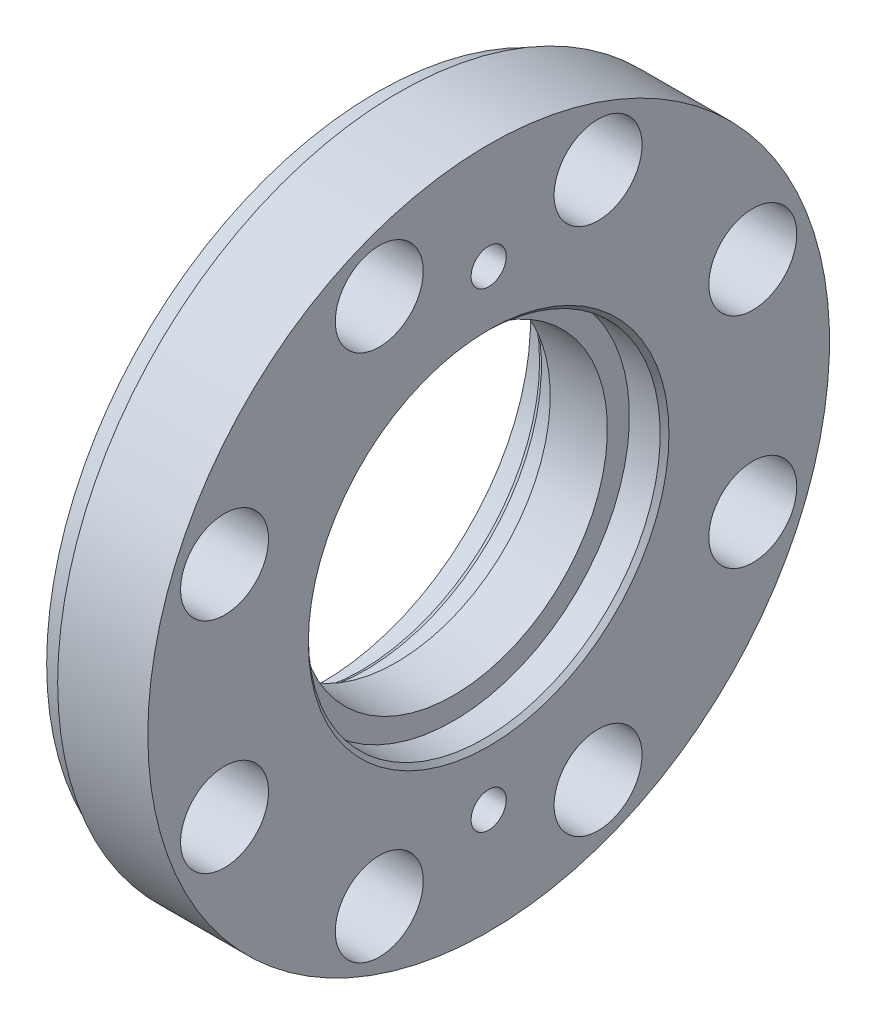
from build123d import *

# Parameters (mm, degrees)
CHANFREIN1_SIZE                                    = 2
CHANFREIN2_SIZE                                    = 1
CHANFREIN2_SIZE2                                   = 0.577350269
CHANFREIN3_SIZE                                    = 1
CHAMBRAGE_POUR_VIS_T_TE_RONDE_BOMB_E_M_D           = 13
CHAMBRAGE_POUR_VIS_T_TE_RONDE_BOMB_E_M_CBORE_D     = 20
CHAMBRAGE_POUR_VIS_T_TE_RONDE_BOMB_E_M_CBORE_DEPTH = 16
R_P_TITION_CIRCULAIRE1_COUNT                       = 8
R_P_TITION_CIRCULAIRE2_COUNT                       = 2


with BuildPart() as part:
    # Esquisse1 → R_volution1 (revolve)
    with BuildSketch(Plane.XY, mode=Mode.PRIVATE) as r_volution1_sk:
        Polygon((0, 0), (0, 55), (3, 55), (3, 51.9), (7.8, 51.9), (7.8, 55), (12.5, 55), (12.5, 75), (17.5, 75), (17.5, 77.5), (38, 77.5), (38, 0), align=None)
    revolve(r_volution1_sk.sketch.rotate(Axis((0, 0, 0), (1, 0, 0)), 90), axis=Axis((0, 0, 0), (1, 0, 0)))

    # Chanfrein1
    chanfrein1_edges = [part.edges().sort_by_distance(p)[0] for p in [
        (0, 0, -55),
    ]]
    chamfer(chanfrein1_edges, length=CHANFREIN1_SIZE)

    # Esquisse2 → Enl_vement de mati_re-R_volution1 (revolve, cut)
    with BuildSketch(Plane.XY, mode=Mode.PRIVATE) as enl_vement_de_mati_re_r_volution1_sk:
        Polygon((0, 0), (0, 47.5), (9, 47.5), (9, 40), (17, 40), (17, 35), (30, 35), (30, 40), (38, 40), (38, 0), align=None)
    revolve(enl_vement_de_mati_re_r_volution1_sk.sketch.rotate(Axis((0, 0, 0), (1, 0, 0)), 90), axis=Axis((0, 0, 0), (1, 0, 0)), mode=Mode.SUBTRACT)

    # Chanfrein2
    chanfrein2_edges = [part.edges().sort_by_distance(p)[0] for p in [
        (9, 0, -40),
    ]]
    chanfrein2_side = [part.faces().sort_by_distance(p)[0] for p in [
        (13, 0, -40),
    ]]
    chamfer(chanfrein2_edges, length=CHANFREIN2_SIZE, length2=CHANFREIN2_SIZE2, reference=chanfrein2_side[0])

    # Chanfrein3
    chanfrein3_edges = [part.edges().sort_by_distance(p)[0] for p in [
        (38, 0, -40),
    ]]
    chamfer(chanfrein3_edges, length=CHANFREIN3_SIZE)

    # Chambrage pour vis _ t_te ronde bomb_e M (through all)
    with Locations(Plane(origin=(38, 0, 0), x_dir=(0, 0, -1), z_dir=(1, 0, 0))):
        with Locations((24.874423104, 60.052169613)):
            chambrage_pour_vis_t_te_ronde_bomb_e_m = CounterBoreHole(CHAMBRAGE_POUR_VIS_T_TE_RONDE_BOMB_E_M_D / 2, CHAMBRAGE_POUR_VIS_T_TE_RONDE_BOMB_E_M_CBORE_D / 2, CHAMBRAGE_POUR_VIS_T_TE_RONDE_BOMB_E_M_CBORE_DEPTH)

    # R_p_tition circulaire1: Chambrage pour vis _ t_te ronde bomb_e M ×8 about axis
    r_p_tition_circulaire1_axis = Axis((0, 0, 0), (1, 0, 0))
    for i in range(1, R_P_TITION_CIRCULAIRE1_COUNT):
        add(chambrage_pour_vis_t_te_ronde_bomb_e_m.rotate(r_p_tition_circulaire1_axis, i * 360 / R_P_TITION_CIRCULAIRE1_COUNT), mode=Mode.SUBTRACT)

    # Esquisse5 → Trou taraud_ M10x1.51 (revolve, cut)
    with BuildSketch(Plane(origin=(38, 53.5, 0), x_dir=(0, 0, -1), z_dir=(0, 1, 0))):
        Polygon((0, 0), (0, 25.403442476), (4, 23), (4, 0), align=None)
    trou_taraud_m10x1_51 = revolve(axis=Axis((44.35, 53.5, 0), (-1, 0, 0)), mode=Mode.SUBTRACT)

    # R_p_tition circulaire2: Trou taraud_ M10x1.51 ×2 about axis
    r_p_tition_circulaire2_axis = Axis((0, 0, 0), (1, 0, 0))
    for i in range(1, R_P_TITION_CIRCULAIRE2_COUNT):
        add(trou_taraud_m10x1_51.rotate(r_p_tition_circulaire2_axis, i * 360 / R_P_TITION_CIRCULAIRE2_COUNT), mode=Mode.SUBTRACT)


solid = part.part
